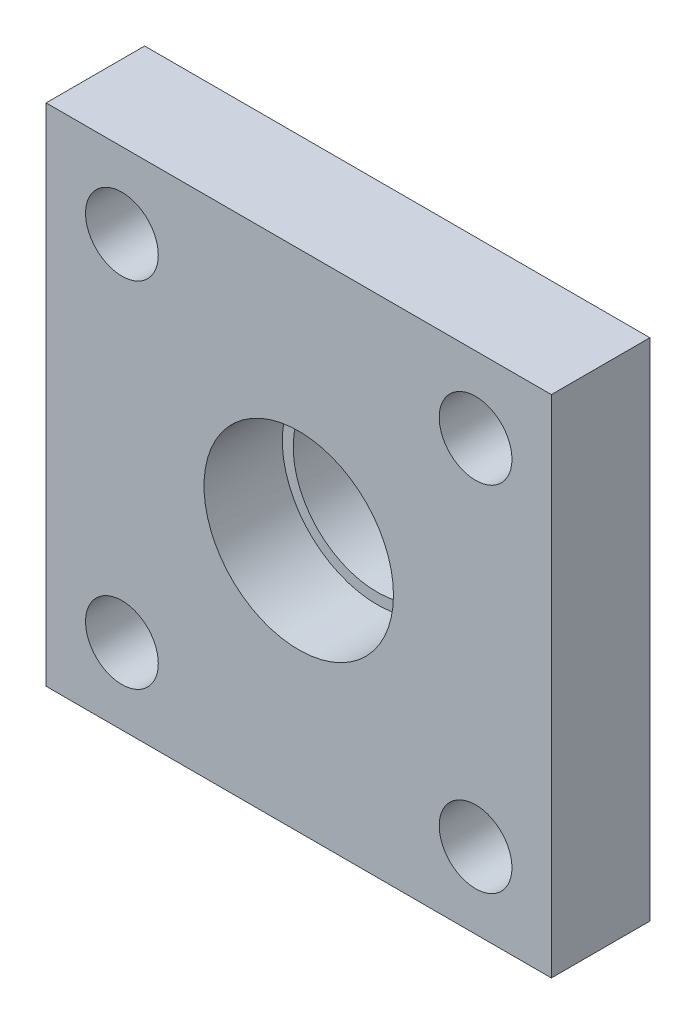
ISO-10303-21;
HEADER;
FILE_DESCRIPTION(('STEP AP214'),'2;1');
FILE_NAME('part.step','',(''),(''),'','','');
FILE_SCHEMA(('AUTOMOTIVE_DESIGN { 1 0 10303 214 1 1 1 1 }'));
ENDSEC;
DATA;
#1=APPLICATION_CONTEXT('core data for automotive mechanical design processes');
#2=APPLICATION_PROTOCOL_DEFINITION('international standard','automotive_design',2000,#1);
#3=PRODUCT_CONTEXT('',#1,'mechanical');
#4=PRODUCT('Part','Part','',(#3));
#5=PRODUCT_RELATED_PRODUCT_CATEGORY('part','',(#4));
#6=PRODUCT_DEFINITION_FORMATION('','',#4);
#7=PRODUCT_DEFINITION_CONTEXT('part definition',#1,'design');
#8=PRODUCT_DEFINITION('design','',#6,#7);
#9=PRODUCT_DEFINITION_SHAPE('','',#8);
#10=(LENGTH_UNIT() NAMED_UNIT(*) SI_UNIT(.MILLI.,.METRE.));
#11=(NAMED_UNIT(*) PLANE_ANGLE_UNIT() SI_UNIT($,.RADIAN.));
#12=(NAMED_UNIT(*) SI_UNIT($,.STERADIAN.) SOLID_ANGLE_UNIT());
#13=UNCERTAINTY_MEASURE_WITH_UNIT(LENGTH_MEASURE(1.E-05),#10,'distance_accuracy_value','');
#14=(GEOMETRIC_REPRESENTATION_CONTEXT(3) GLOBAL_UNCERTAINTY_ASSIGNED_CONTEXT((#13)) GLOBAL_UNIT_ASSIGNED_CONTEXT((#10,
#11,#12)) REPRESENTATION_CONTEXT('',''));
#15=CARTESIAN_POINT('',(0.,0.,0.));
#16=DIRECTION('',(0.,0.,1.));
#17=DIRECTION('',(1.,0.,0.));
#18=AXIS2_PLACEMENT_3D('',#15,#16,#17);
#19=CARTESIAN_POINT('',(24.6888,2.0701,4.953));
#20=DIRECTION('',(0.,0.,-1.));
#21=DIRECTION('',(-1.,0.,0.));
#22=AXIS2_PLACEMENT_3D('',#19,#20,#21);
#23=CYLINDRICAL_SURFACE('',#22,4.2164);
#24=CARTESIAN_POINT('',(24.6888,2.0701,-4.572));
#25=DIRECTION('',(0.,0.,1.));
#26=DIRECTION('',(1.,0.,0.));
#27=AXIS2_PLACEMENT_3D('',#24,#25,#26);
#28=CIRCLE('',#27,4.2164);
#29=CARTESIAN_POINT('',(28.9052,2.0701,-4.572));
#30=VERTEX_POINT('',#29);
#31=EDGE_CURVE('E316',#30,#30,#28,.T.);
#32=ORIENTED_EDGE('',*,*,#31,.F.);
#33=EDGE_LOOP('',(#32));
#34=FACE_BOUND('',#33,.T.);
#35=CARTESIAN_POINT('',(24.6888,2.0701,1.016));
#36=DIRECTION('',(0.,0.,1.));
#37=DIRECTION('',(1.,0.,0.));
#38=AXIS2_PLACEMENT_3D('',#35,#36,#37);
#39=CIRCLE('',#38,4.2164);
#40=CARTESIAN_POINT('',(28.9052,2.0701,1.016));
#41=VERTEX_POINT('',#40);
#42=EDGE_CURVE('E33',#41,#41,#39,.T.);
#43=ORIENTED_EDGE('',*,*,#42,.T.);
#44=EDGE_LOOP('',(#43));
#45=FACE_BOUND('',#44,.T.);
#46=ADVANCED_FACE('F29',(#34,#45),#23,.F.);
#47=CARTESIAN_POINT('',(11.9888,-10.6299,4.953));
#48=DIRECTION('',(0.,0.,1.));
#49=DIRECTION('',(1.,0.,0.));
#50=AXIS2_PLACEMENT_3D('',#47,#48,#49);
#51=PLANE('',#50);
#52=CARTESIAN_POINT('',(24.6888,2.0701,4.953));
#53=DIRECTION('',(0.,0.,1.));
#54=DIRECTION('',(1.,0.,0.));
#55=AXIS2_PLACEMENT_3D('',#52,#53,#54);
#56=CIRCLE('',#55,4.7625);
#57=CARTESIAN_POINT('',(29.4513,2.0701,4.953));
#58=VERTEX_POINT('',#57);
#59=EDGE_CURVE('E314',#58,#58,#56,.T.);
#60=ORIENTED_EDGE('',*,*,#59,.F.);
#61=EDGE_LOOP('',(#60));
#62=FACE_BOUND('',#61,.T.);
#63=CARTESIAN_POINT('',(15.7988,-6.81989999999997,4.953));
#64=DIRECTION('',(0.,0.,1.));
#65=DIRECTION('',(1.,0.,0.));
#66=AXIS2_PLACEMENT_3D('',#63,#64,#65);
#67=CIRCLE('',#66,1.8288);
#68=CARTESIAN_POINT('',(17.6276,-6.81989999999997,4.953));
#69=VERTEX_POINT('',#68);
#70=EDGE_CURVE('E325',#69,#69,#67,.T.);
#71=ORIENTED_EDGE('',*,*,#70,.F.);
#72=EDGE_LOOP('',(#71));
#73=FACE_BOUND('',#72,.T.);
#74=CARTESIAN_POINT('',(33.5788,10.9601,4.953));
#75=DIRECTION('',(0.,0.,1.));
#76=DIRECTION('',(1.,0.,0.));
#77=AXIS2_PLACEMENT_3D('',#74,#75,#76);
#78=CIRCLE('',#77,1.8288);
#79=CARTESIAN_POINT('',(35.4076,10.9601,4.953));
#80=VERTEX_POINT('',#79);
#81=EDGE_CURVE('E337',#80,#80,#78,.T.);
#82=ORIENTED_EDGE('',*,*,#81,.F.);
#83=EDGE_LOOP('',(#82));
#84=FACE_BOUND('',#83,.T.);
#85=DIRECTION('',(0.,-1.,0.));
#86=VECTOR('',#85,1.);
#87=CARTESIAN_POINT('',(11.9888,14.7701,4.953));
#88=LINE('',#87,#86);
#89=CARTESIAN_POINT('',(11.9888,14.7701,4.953));
#90=VERTEX_POINT('',#89);
#91=CARTESIAN_POINT('',(11.9888,-10.6299,4.953));
#92=VERTEX_POINT('',#91);
#93=EDGE_CURVE('E131',#90,#92,#88,.T.);
#94=ORIENTED_EDGE('',*,*,#93,.T.);
#95=DIRECTION('',(1.,0.,0.));
#96=VECTOR('',#95,1.);
#97=CARTESIAN_POINT('',(11.9888,-10.6299,4.953));
#98=LINE('',#97,#96);
#99=CARTESIAN_POINT('',(37.3888,-10.6299,4.953));
#100=VERTEX_POINT('',#99);
#101=EDGE_CURVE('E110',#92,#100,#98,.T.);
#102=ORIENTED_EDGE('',*,*,#101,.T.);
#103=DIRECTION('',(0.,1.,0.));
#104=VECTOR('',#103,1.);
#105=CARTESIAN_POINT('',(37.3888,14.7701,4.953));
#106=LINE('',#105,#104);
#107=CARTESIAN_POINT('',(37.3888,14.7701,4.953));
#108=VERTEX_POINT('',#107);
#109=EDGE_CURVE('E134',#100,#108,#106,.T.);
#110=ORIENTED_EDGE('',*,*,#109,.T.);
#111=DIRECTION('',(-1.,0.,0.));
#112=VECTOR('',#111,1.);
#113=CARTESIAN_POINT('',(11.9888,14.7701,4.953));
#114=LINE('',#113,#112);
#115=EDGE_CURVE('E136',#108,#90,#114,.T.);
#116=ORIENTED_EDGE('',*,*,#115,.T.);
#117=EDGE_LOOP('',(#94,#102,#110,#116));
#118=FACE_BOUND('',#117,.T.);
#119=CARTESIAN_POINT('',(15.7987999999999,10.9600999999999,4.953));
#120=DIRECTION('',(0.,0.,1.));
#121=DIRECTION('',(1.,0.,0.));
#122=AXIS2_PLACEMENT_3D('',#119,#120,#121);
#123=CIRCLE('',#122,1.8288);
#124=CARTESIAN_POINT('',(17.6275999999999,10.9600999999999,4.953));
#125=VERTEX_POINT('',#124);
#126=EDGE_CURVE('E121',#125,#125,#123,.T.);
#127=ORIENTED_EDGE('',*,*,#126,.F.);
#128=EDGE_LOOP('',(#127));
#129=FACE_BOUND('',#128,.T.);
#130=CARTESIAN_POINT('',(33.5788,-6.8199,4.953));
#131=DIRECTION('',(0.,0.,1.));
#132=DIRECTION('',(1.,0.,0.));
#133=AXIS2_PLACEMENT_3D('',#130,#131,#132);
#134=CIRCLE('',#133,1.8288);
#135=CARTESIAN_POINT('',(35.4076,-6.8199,4.953));
#136=VERTEX_POINT('',#135);
#137=EDGE_CURVE('E331',#136,#136,#134,.T.);
#138=ORIENTED_EDGE('',*,*,#137,.F.);
#139=EDGE_LOOP('',(#138));
#140=FACE_BOUND('',#139,.T.);
#141=ADVANCED_FACE('F188',(#62,#73,#84,#118,#129,#140),#51,.T.);
#142=CARTESIAN_POINT('',(18.3388,-4.2799,-4.572));
#143=DIRECTION('',(0.,0.,1.));
#144=DIRECTION('',(1.,0.,0.));
#145=AXIS2_PLACEMENT_3D('',#142,#143,#144);
#146=PLANE('',#145);
#147=DIRECTION('',(0.,-1.,0.));
#148=VECTOR('',#147,1.);
#149=CARTESIAN_POINT('',(18.3388,8.4201,-4.572));
#150=LINE('',#149,#148);
#151=CARTESIAN_POINT('',(18.3388,8.4201,-4.572));
#152=VERTEX_POINT('',#151);
#153=CARTESIAN_POINT('',(18.3388,-4.2799,-4.572));
#154=VERTEX_POINT('',#153);
#155=EDGE_CURVE('E154',#152,#154,#150,.T.);
#156=ORIENTED_EDGE('',*,*,#155,.F.);
#157=DIRECTION('',(-1.,0.,0.));
#158=VECTOR('',#157,1.);
#159=CARTESIAN_POINT('',(18.3388,8.4201,-4.572));
#160=LINE('',#159,#158);
#161=CARTESIAN_POINT('',(31.0388,8.4201,-4.572));
#162=VERTEX_POINT('',#161);
#163=EDGE_CURVE('E161',#162,#152,#160,.T.);
#164=ORIENTED_EDGE('',*,*,#163,.F.);
#165=DIRECTION('',(0.,1.,0.));
#166=VECTOR('',#165,1.);
#167=CARTESIAN_POINT('',(31.0388,8.4201,-4.572));
#168=LINE('',#167,#166);
#169=CARTESIAN_POINT('',(31.0388,-4.2799,-4.572));
#170=VERTEX_POINT('',#169);
#171=EDGE_CURVE('E159',#170,#162,#168,.T.);
#172=ORIENTED_EDGE('',*,*,#171,.F.);
#173=DIRECTION('',(1.,0.,0.));
#174=VECTOR('',#173,1.);
#175=CARTESIAN_POINT('',(18.3388,-4.2799,-4.572));
#176=LINE('',#175,#174);
#177=EDGE_CURVE('E156',#154,#170,#176,.T.);
#178=ORIENTED_EDGE('',*,*,#177,.F.);
#179=EDGE_LOOP('',(#156,#164,#172,#178));
#180=FACE_BOUND('',#179,.T.);
#181=ORIENTED_EDGE('',*,*,#31,.T.);
#182=EDGE_LOOP('',(#181));
#183=FACE_BOUND('',#182,.T.);
#184=ADVANCED_FACE('F176',(#180,#183),#146,.F.);
#185=CARTESIAN_POINT('',(11.9888,-10.6299,0.));
#186=DIRECTION('',(0.,0.,1.));
#187=DIRECTION('',(1.,0.,0.));
#188=AXIS2_PLACEMENT_3D('',#185,#186,#187);
#189=PLANE('',#188);
#190=CARTESIAN_POINT('',(33.5788,-6.8199,0.));
#191=DIRECTION('',(0.,0.,1.));
#192=DIRECTION('',(1.,0.,0.));
#193=AXIS2_PLACEMENT_3D('',#190,#191,#192);
#194=CIRCLE('',#193,1.8288);
#195=CARTESIAN_POINT('',(35.4076,-6.8199,0.));
#196=VERTEX_POINT('',#195);
#197=EDGE_CURVE('E328',#196,#196,#194,.T.);
#198=ORIENTED_EDGE('',*,*,#197,.T.);
#199=EDGE_LOOP('',(#198));
#200=FACE_BOUND('',#199,.T.);
#201=CARTESIAN_POINT('',(15.7987999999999,10.9600999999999,0.));
#202=DIRECTION('',(0.,0.,1.));
#203=DIRECTION('',(1.,0.,0.));
#204=AXIS2_PLACEMENT_3D('',#201,#202,#203);
#205=CIRCLE('',#204,1.8288);
#206=CARTESIAN_POINT('',(17.6275999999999,10.9600999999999,0.));
#207=VERTEX_POINT('',#206);
#208=EDGE_CURVE('E124',#207,#207,#205,.T.);
#209=ORIENTED_EDGE('',*,*,#208,.T.);
#210=EDGE_LOOP('',(#209));
#211=FACE_BOUND('',#210,.T.);
#212=DIRECTION('',(0.,-1.,0.));
#213=VECTOR('',#212,1.);
#214=CARTESIAN_POINT('',(18.3388,8.4201,0.));
#215=LINE('',#214,#213);
#216=CARTESIAN_POINT('',(18.3388,8.4201,0.));
#217=VERTEX_POINT('',#216);
#218=CARTESIAN_POINT('',(18.3388,-4.2799,0.));
#219=VERTEX_POINT('',#218);
#220=EDGE_CURVE('E114',#217,#219,#215,.T.);
#221=ORIENTED_EDGE('',*,*,#220,.T.);
#222=DIRECTION('',(1.,0.,0.));
#223=VECTOR('',#222,1.);
#224=CARTESIAN_POINT('',(18.3388,-4.2799,0.));
#225=LINE('',#224,#223);
#226=CARTESIAN_POINT('',(31.0388,-4.2799,0.));
#227=VERTEX_POINT('',#226);
#228=EDGE_CURVE('E145',#219,#227,#225,.T.);
#229=ORIENTED_EDGE('',*,*,#228,.T.);
#230=DIRECTION('',(0.,1.,0.));
#231=VECTOR('',#230,1.);
#232=CARTESIAN_POINT('',(31.0388,8.4201,0.));
#233=LINE('',#232,#231);
#234=CARTESIAN_POINT('',(31.0388,8.4201,0.));
#235=VERTEX_POINT('',#234);
#236=EDGE_CURVE('E148',#227,#235,#233,.T.);
#237=ORIENTED_EDGE('',*,*,#236,.T.);
#238=DIRECTION('',(-1.,0.,0.));
#239=VECTOR('',#238,1.);
#240=CARTESIAN_POINT('',(18.3388,8.4201,0.));
#241=LINE('',#240,#239);
#242=EDGE_CURVE('E151',#235,#217,#241,.T.);
#243=ORIENTED_EDGE('',*,*,#242,.T.);
#244=EDGE_LOOP('',(#221,#229,#237,#243));
#245=FACE_BOUND('',#244,.T.);
#246=DIRECTION('',(0.,-1.,0.));
#247=VECTOR('',#246,1.);
#248=CARTESIAN_POINT('',(11.9888,14.7701,0.));
#249=LINE('',#248,#247);
#250=CARTESIAN_POINT('',(11.9888,14.7701,0.));
#251=VERTEX_POINT('',#250);
#252=CARTESIAN_POINT('',(11.9888,-10.6299,0.));
#253=VERTEX_POINT('',#252);
#254=EDGE_CURVE('E101',#251,#253,#249,.T.);
#255=ORIENTED_EDGE('',*,*,#254,.F.);
#256=DIRECTION('',(-1.,0.,0.));
#257=VECTOR('',#256,1.);
#258=CARTESIAN_POINT('',(11.9888,14.7701,0.));
#259=LINE('',#258,#257);
#260=CARTESIAN_POINT('',(37.3888,14.7701,0.));
#261=VERTEX_POINT('',#260);
#262=EDGE_CURVE('E129',#261,#251,#259,.T.);
#263=ORIENTED_EDGE('',*,*,#262,.F.);
#264=DIRECTION('',(0.,1.,0.));
#265=VECTOR('',#264,1.);
#266=CARTESIAN_POINT('',(37.3888,14.7701,0.));
#267=LINE('',#266,#265);
#268=CARTESIAN_POINT('',(37.3888,-10.6299,0.));
#269=VERTEX_POINT('',#268);
#270=EDGE_CURVE('E102',#269,#261,#267,.T.);
#271=ORIENTED_EDGE('',*,*,#270,.F.);
#272=DIRECTION('',(1.,0.,0.));
#273=VECTOR('',#272,1.);
#274=CARTESIAN_POINT('',(11.9888,-10.6299,0.));
#275=LINE('',#274,#273);
#276=EDGE_CURVE('E95',#253,#269,#275,.T.);
#277=ORIENTED_EDGE('',*,*,#276,.F.);
#278=EDGE_LOOP('',(#255,#263,#271,#277));
#279=FACE_BOUND('',#278,.T.);
#280=CARTESIAN_POINT('',(33.5788,10.9601,0.));
#281=DIRECTION('',(0.,0.,1.));
#282=DIRECTION('',(1.,0.,0.));
#283=AXIS2_PLACEMENT_3D('',#280,#281,#282);
#284=CIRCLE('',#283,1.8288);
#285=CARTESIAN_POINT('',(35.4076,10.9601,0.));
#286=VERTEX_POINT('',#285);
#287=EDGE_CURVE('E334',#286,#286,#284,.T.);
#288=ORIENTED_EDGE('',*,*,#287,.T.);
#289=EDGE_LOOP('',(#288));
#290=FACE_BOUND('',#289,.T.);
#291=CARTESIAN_POINT('',(15.7988,-6.81989999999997,0.));
#292=DIRECTION('',(0.,0.,1.));
#293=DIRECTION('',(1.,0.,0.));
#294=AXIS2_PLACEMENT_3D('',#291,#292,#293);
#295=CIRCLE('',#294,1.8288);
#296=CARTESIAN_POINT('',(17.6276,-6.81989999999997,0.));
#297=VERTEX_POINT('',#296);
#298=EDGE_CURVE('E322',#297,#297,#295,.T.);
#299=ORIENTED_EDGE('',*,*,#298,.T.);
#300=EDGE_LOOP('',(#299));
#301=FACE_BOUND('',#300,.T.);
#302=ADVANCED_FACE('F97',(#200,#211,#245,#279,#290,#301),#189,.F.);
#303=CARTESIAN_POINT('',(18.3388,8.4201,-4.572));
#304=DIRECTION('',(-1.,0.,0.));
#305=DIRECTION('',(0.,0.,1.));
#306=AXIS2_PLACEMENT_3D('',#303,#304,#305);
#307=PLANE('',#306);
#308=ORIENTED_EDGE('',*,*,#220,.F.);
#309=DIRECTION('',(0.,0.,1.));
#310=VECTOR('',#309,1.);
#311=CARTESIAN_POINT('',(18.3388,8.4201,-4.572));
#312=LINE('',#311,#310);
#313=EDGE_CURVE('E11',#152,#217,#312,.T.);
#314=ORIENTED_EDGE('',*,*,#313,.F.);
#315=ORIENTED_EDGE('',*,*,#155,.T.);
#316=DIRECTION('',(0.,0.,1.));
#317=VECTOR('',#316,1.);
#318=CARTESIAN_POINT('',(18.3388,-4.2799,-4.572));
#319=LINE('',#318,#317);
#320=EDGE_CURVE('E162',#154,#219,#319,.T.);
#321=ORIENTED_EDGE('',*,*,#320,.T.);
#322=EDGE_LOOP('',(#308,#314,#315,#321));
#323=FACE_BOUND('',#322,.T.);
#324=ADVANCED_FACE('F31',(#323),#307,.T.);
#325=CARTESIAN_POINT('',(18.3388,8.4201,-4.572));
#326=DIRECTION('',(0.,1.,0.));
#327=DIRECTION('',(0.,0.,1.));
#328=AXIS2_PLACEMENT_3D('',#325,#326,#327);
#329=PLANE('',#328);
#330=ORIENTED_EDGE('',*,*,#242,.F.);
#331=DIRECTION('',(0.,0.,1.));
#332=VECTOR('',#331,1.);
#333=CARTESIAN_POINT('',(31.0388,8.4201,-4.572));
#334=LINE('',#333,#332);
#335=EDGE_CURVE('E38',#162,#235,#334,.T.);
#336=ORIENTED_EDGE('',*,*,#335,.F.);
#337=ORIENTED_EDGE('',*,*,#163,.T.);
#338=ORIENTED_EDGE('',*,*,#313,.T.);
#339=EDGE_LOOP('',(#330,#336,#337,#338));
#340=FACE_BOUND('',#339,.T.);
#341=ADVANCED_FACE('F172',(#340),#329,.T.);
#342=CARTESIAN_POINT('',(31.0388,8.4201,-4.572));
#343=DIRECTION('',(1.,0.,0.));
#344=DIRECTION('',(0.,1.,0.));
#345=AXIS2_PLACEMENT_3D('',#342,#343,#344);
#346=PLANE('',#345);
#347=ORIENTED_EDGE('',*,*,#236,.F.);
#348=DIRECTION('',(0.,0.,1.));
#349=VECTOR('',#348,1.);
#350=CARTESIAN_POINT('',(31.0388,-4.2799,-4.572));
#351=LINE('',#350,#349);
#352=EDGE_CURVE('E165',#170,#227,#351,.T.);
#353=ORIENTED_EDGE('',*,*,#352,.F.);
#354=ORIENTED_EDGE('',*,*,#171,.T.);
#355=ORIENTED_EDGE('',*,*,#335,.T.);
#356=EDGE_LOOP('',(#347,#353,#354,#355));
#357=FACE_BOUND('',#356,.T.);
#358=ADVANCED_FACE('F179',(#357),#346,.T.);
#359=CARTESIAN_POINT('',(18.3388,-4.2799,-4.572));
#360=DIRECTION('',(0.,-1.,0.));
#361=DIRECTION('',(0.,0.,-1.));
#362=AXIS2_PLACEMENT_3D('',#359,#360,#361);
#363=PLANE('',#362);
#364=ORIENTED_EDGE('',*,*,#228,.F.);
#365=ORIENTED_EDGE('',*,*,#320,.F.);
#366=ORIENTED_EDGE('',*,*,#177,.T.);
#367=ORIENTED_EDGE('',*,*,#352,.T.);
#368=EDGE_LOOP('',(#364,#365,#366,#367));
#369=FACE_BOUND('',#368,.T.);
#370=ADVANCED_FACE('F170',(#369),#363,.T.);
#371=CARTESIAN_POINT('',(11.9888,14.7701,4.953));
#372=DIRECTION('',(1.,0.,0.));
#373=DIRECTION('',(0.,1.,0.));
#374=AXIS2_PLACEMENT_3D('',#371,#372,#373);
#375=PLANE('',#374);
#376=ORIENTED_EDGE('',*,*,#254,.T.);
#377=DIRECTION('',(0.,0.,-1.));
#378=VECTOR('',#377,1.);
#379=CARTESIAN_POINT('',(11.9888,-10.6299,4.953));
#380=LINE('',#379,#378);
#381=EDGE_CURVE('E108',#92,#253,#380,.T.);
#382=ORIENTED_EDGE('',*,*,#381,.F.);
#383=ORIENTED_EDGE('',*,*,#93,.F.);
#384=DIRECTION('',(0.,0.,-1.));
#385=VECTOR('',#384,1.);
#386=CARTESIAN_POINT('',(11.9888,14.7701,4.953));
#387=LINE('',#386,#385);
#388=EDGE_CURVE('E120',#90,#251,#387,.T.);
#389=ORIENTED_EDGE('',*,*,#388,.T.);
#390=EDGE_LOOP('',(#376,#382,#383,#389));
#391=FACE_BOUND('',#390,.T.);
#392=ADVANCED_FACE('F118',(#391),#375,.F.);
#393=CARTESIAN_POINT('',(11.9888,-10.6299,4.953));
#394=DIRECTION('',(0.,1.,0.));
#395=DIRECTION('',(0.,0.,1.));
#396=AXIS2_PLACEMENT_3D('',#393,#394,#395);
#397=PLANE('',#396);
#398=ORIENTED_EDGE('',*,*,#276,.T.);
#399=DIRECTION('',(0.,0.,-1.));
#400=VECTOR('',#399,1.);
#401=CARTESIAN_POINT('',(37.3888,-10.6299,4.953));
#402=LINE('',#401,#400);
#403=EDGE_CURVE('E115',#100,#269,#402,.T.);
#404=ORIENTED_EDGE('',*,*,#403,.F.);
#405=ORIENTED_EDGE('',*,*,#101,.F.);
#406=ORIENTED_EDGE('',*,*,#381,.T.);
#407=EDGE_LOOP('',(#398,#404,#405,#406));
#408=FACE_BOUND('',#407,.T.);
#409=ADVANCED_FACE('F109',(#408),#397,.F.);
#410=CARTESIAN_POINT('',(37.3888,14.7701,4.953));
#411=DIRECTION('',(-1.,0.,0.));
#412=DIRECTION('',(0.,0.,1.));
#413=AXIS2_PLACEMENT_3D('',#410,#411,#412);
#414=PLANE('',#413);
#415=ORIENTED_EDGE('',*,*,#270,.T.);
#416=DIRECTION('',(0.,0.,-1.));
#417=VECTOR('',#416,1.);
#418=CARTESIAN_POINT('',(37.3888,14.7701,4.953));
#419=LINE('',#418,#417);
#420=EDGE_CURVE('E139',#108,#261,#419,.T.);
#421=ORIENTED_EDGE('',*,*,#420,.F.);
#422=ORIENTED_EDGE('',*,*,#109,.F.);
#423=ORIENTED_EDGE('',*,*,#403,.T.);
#424=EDGE_LOOP('',(#415,#421,#422,#423));
#425=FACE_BOUND('',#424,.T.);
#426=ADVANCED_FACE('F225',(#425),#414,.F.);
#427=CARTESIAN_POINT('',(11.9888,14.7701,4.953));
#428=DIRECTION('',(0.,-1.,0.));
#429=DIRECTION('',(0.,0.,-1.));
#430=AXIS2_PLACEMENT_3D('',#427,#428,#429);
#431=PLANE('',#430);
#432=ORIENTED_EDGE('',*,*,#262,.T.);
#433=ORIENTED_EDGE('',*,*,#388,.F.);
#434=ORIENTED_EDGE('',*,*,#115,.F.);
#435=ORIENTED_EDGE('',*,*,#420,.T.);
#436=EDGE_LOOP('',(#432,#433,#434,#435));
#437=FACE_BOUND('',#436,.T.);
#438=ADVANCED_FACE('F218',(#437),#431,.F.);
#439=CARTESIAN_POINT('',(15.7987999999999,10.9600999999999,4.953));
#440=DIRECTION('',(0.,0.,-1.));
#441=DIRECTION('',(-1.,0.,0.));
#442=AXIS2_PLACEMENT_3D('',#439,#440,#441);
#443=CYLINDRICAL_SURFACE('',#442,1.8288);
#444=ORIENTED_EDGE('',*,*,#126,.T.);
#445=EDGE_LOOP('',(#444));
#446=FACE_BOUND('',#445,.T.);
#447=ORIENTED_EDGE('',*,*,#208,.F.);
#448=EDGE_LOOP('',(#447));
#449=FACE_BOUND('',#448,.T.);
#450=ADVANCED_FACE('F214',(#446,#449),#443,.F.);
#451=CARTESIAN_POINT('',(33.5788,10.9601,4.953));
#452=DIRECTION('',(0.,0.,-1.));
#453=DIRECTION('',(-1.,0.,0.));
#454=AXIS2_PLACEMENT_3D('',#451,#452,#453);
#455=CYLINDRICAL_SURFACE('',#454,1.8288);
#456=ORIENTED_EDGE('',*,*,#81,.T.);
#457=EDGE_LOOP('',(#456));
#458=FACE_BOUND('',#457,.T.);
#459=ORIENTED_EDGE('',*,*,#287,.F.);
#460=EDGE_LOOP('',(#459));
#461=FACE_BOUND('',#460,.T.);
#462=ADVANCED_FACE('F210',(#458,#461),#455,.F.);
#463=CARTESIAN_POINT('',(33.5788,-6.8199,4.953));
#464=DIRECTION('',(0.,0.,-1.));
#465=DIRECTION('',(-1.,0.,0.));
#466=AXIS2_PLACEMENT_3D('',#463,#464,#465);
#467=CYLINDRICAL_SURFACE('',#466,1.8288);
#468=ORIENTED_EDGE('',*,*,#137,.T.);
#469=EDGE_LOOP('',(#468));
#470=FACE_BOUND('',#469,.T.);
#471=ORIENTED_EDGE('',*,*,#197,.F.);
#472=EDGE_LOOP('',(#471));
#473=FACE_BOUND('',#472,.T.);
#474=ADVANCED_FACE('F206',(#470,#473),#467,.F.);
#475=CARTESIAN_POINT('',(15.7988,-6.81989999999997,4.953));
#476=DIRECTION('',(0.,0.,-1.));
#477=DIRECTION('',(-1.,0.,0.));
#478=AXIS2_PLACEMENT_3D('',#475,#476,#477);
#479=CYLINDRICAL_SURFACE('',#478,1.8288);
#480=ORIENTED_EDGE('',*,*,#70,.T.);
#481=EDGE_LOOP('',(#480));
#482=FACE_BOUND('',#481,.T.);
#483=ORIENTED_EDGE('',*,*,#298,.F.);
#484=EDGE_LOOP('',(#483));
#485=FACE_BOUND('',#484,.T.);
#486=ADVANCED_FACE('F203',(#482,#485),#479,.F.);
#487=CARTESIAN_POINT('',(24.6888,2.0701,1.016));
#488=DIRECTION('',(0.,0.,1.));
#489=DIRECTION('',(1.,0.,0.));
#490=AXIS2_PLACEMENT_3D('',#487,#488,#489);
#491=CYLINDRICAL_SURFACE('',#490,4.7625);
#492=CARTESIAN_POINT('',(24.6888,2.0701,1.016));
#493=DIRECTION('',(0.,0.,1.));
#494=DIRECTION('',(1.,0.,0.));
#495=AXIS2_PLACEMENT_3D('',#492,#493,#494);
#496=CIRCLE('',#495,4.7625);
#497=CARTESIAN_POINT('',(29.4513,2.0701,1.016));
#498=VERTEX_POINT('',#497);
#499=EDGE_CURVE('E313',#498,#498,#496,.T.);
#500=ORIENTED_EDGE('',*,*,#499,.F.);
#501=EDGE_LOOP('',(#500));
#502=FACE_BOUND('',#501,.T.);
#503=ORIENTED_EDGE('',*,*,#59,.T.);
#504=EDGE_LOOP('',(#503));
#505=FACE_BOUND('',#504,.T.);
#506=ADVANCED_FACE('F201',(#502,#505),#491,.F.);
#507=CARTESIAN_POINT('',(24.6888,2.0701,1.016));
#508=DIRECTION('',(0.,0.,1.));
#509=DIRECTION('',(1.,0.,0.));
#510=AXIS2_PLACEMENT_3D('',#507,#508,#509);
#511=PLANE('',#510);
#512=ORIENTED_EDGE('',*,*,#42,.F.);
#513=EDGE_LOOP('',(#512));
#514=FACE_BOUND('',#513,.T.);
#515=ORIENTED_EDGE('',*,*,#499,.T.);
#516=EDGE_LOOP('',(#515));
#517=FACE_BOUND('',#516,.T.);
#518=ADVANCED_FACE('F300',(#514,#517),#511,.T.);
#519=CLOSED_SHELL('',(#46,#141,#184,#302,#324,#341,#358,#370,#392,#409,#426,#438,#450,#462,#474,
#486,#506,#518));
#520=MANIFOLD_SOLID_BREP('B2',#519);
#521=ADVANCED_BREP_SHAPE_REPRESENTATION('',(#18,#520),#14);
#522=SHAPE_DEFINITION_REPRESENTATION(#9,#521);
ENDSEC;
END-ISO-10303-21;
